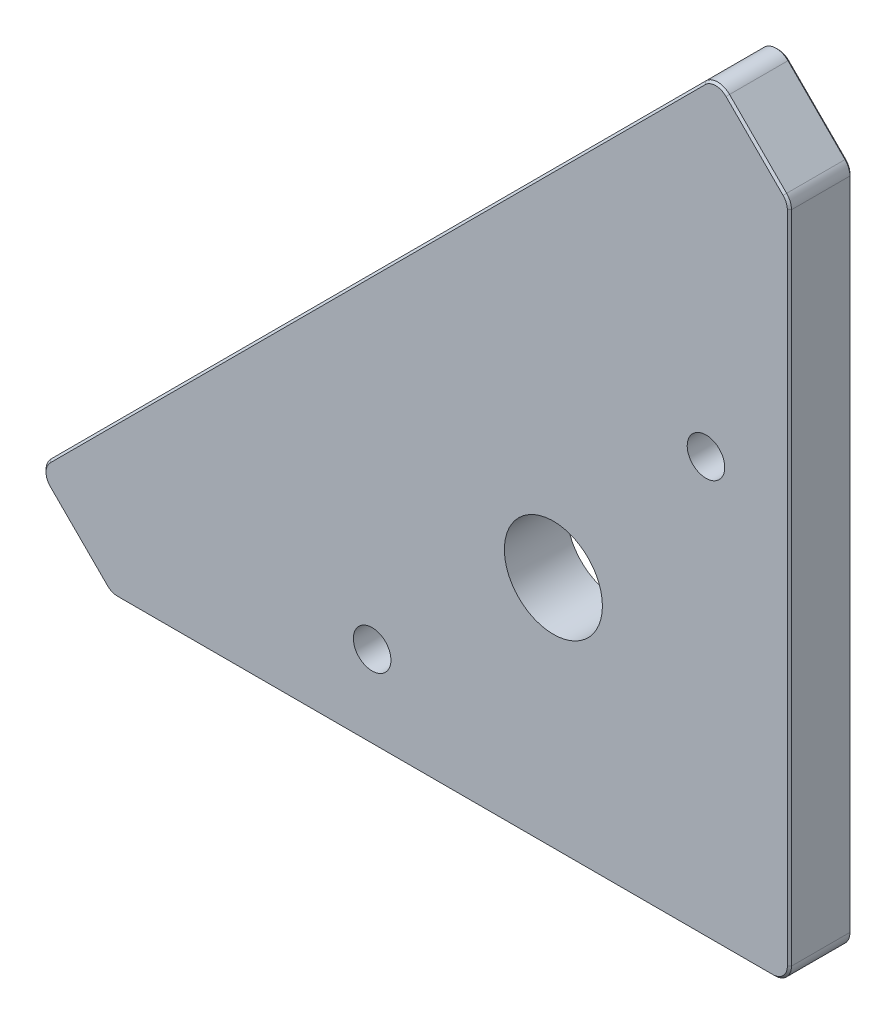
from build123d import *

# Parameters (mm, degrees)
AUFSATZ_LINEAR_AUSTRAGEN1_DEPTH                      = 15
SCHNITT_LINEAR_AUSTRAGEN2_DEPTH                      = 281.401497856
VERRUNDUNG1_R                                        = 4
M25X1_5_GEWINDEBOHRUNG1_D                            = 23.5
M25X1_5_GEWINDEBOHRUNG1_DEPTH                        = 57.5
M25X1_5_GEWINDEBOHRUNG1_TIP                          = 7.060112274
FORMSENKUNG_F_R_M8_SENKSCHRAUBE_MIT_INNE_D           = 9
FORMSENKUNG_F_R_M8_SENKSCHRAUBE_MIT_INNE_CSINK_D     = 18.25
FORMSENKUNG_F_R_M8_SENKSCHRAUBE_MIT_INNE_CSINK_ANGLE = 90
FASE1_SIZE                                           = 0.5


with BuildPart() as part:
    # Skizze1 → Aufsatz-Linear austragen1 (new body)
    with BuildSketch(Plane.XY):
        Polygon((0, 0), (-197.989898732, 0), (0, 197.989898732), align=None)
    extrude(amount=AUFSATZ_LINEAR_AUSTRAGEN1_DEPTH)

    # Skizze4 → Schnitt-Linear austragen2 (cut, through all)
    with BuildSketch(Plane(origin=(0, 0, 0), x_dir=(-1, 0, 0), z_dir=(0, 0, -1))):
        Polygon((0, 162.634559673), (17.67766953, 180.312229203), (0, 197.989898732), align=None)
        Polygon((162.634559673, 0), (180.312229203, 17.67766953), (197.989898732, 0), align=None)
    extrude(amount=-SCHNITT_LINEAR_AUSTRAGEN2_DEPTH, mode=Mode.SUBTRACT)

    # Verrundung1
    verrundung1_edges = [part.edges().sort_by_distance(p)[0] for p in [
        (0, 162.634559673, 7.5),
        (-17.67766953, 180.312229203, 7.5),
        (-162.634559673, 0, 7.5),
        (-180.312229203, 17.67766953, 7.5),
        (0, 0, 7.5),
    ]]
    fillet(verrundung1_edges, radius=VERRUNDUNG1_R)

    # M25x1.5 Gewindebohrung1
    with Locations(Plane.XY.offset(15)):
        with Locations((-56.568542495, 56.568542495)):
            Hole(M25X1_5_GEWINDEBOHRUNG1_D / 2, depth=M25X1_5_GEWINDEBOHRUNG1_DEPTH)
            with Locations((0, 0, -(M25X1_5_GEWINDEBOHRUNG1_DEPTH + M25X1_5_GEWINDEBOHRUNG1_TIP / 2))):  # 118° drill point
                Cone(0, M25X1_5_GEWINDEBOHRUNG1_D / 2, M25X1_5_GEWINDEBOHRUNG1_TIP, mode=Mode.SUBTRACT)

    # Formsenkung f_r M8 Senkschraube mit Inne (through all)
    with Locations(Plane(origin=(0, 0, 0), x_dir=(1, 0, 0), z_dir=(0, 0, -1))):
        with Locations((-20, -100), (-100, -20)):
            CounterSinkHole(FORMSENKUNG_F_R_M8_SENKSCHRAUBE_MIT_INNE_D / 2, FORMSENKUNG_F_R_M8_SENKSCHRAUBE_MIT_INNE_CSINK_D / 2, counter_sink_angle=FORMSENKUNG_F_R_M8_SENKSCHRAUBE_MIT_INNE_CSINK_ANGLE)

    # Fase1
    fase1_edges = [part.edges().sort_by_distance(p)[0] for p in [
        (-8.01040764, 170.644967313, 0),
        (-8.01040764, 170.644967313, 15),
        (0, 82.488852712, 0),
        (-82.488852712, 0, 0),
        (-170.644967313, 8.01040764, 0),
        (-98.994949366, 98.994949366, 0),
        (-1.171572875, 1.171572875, 0),
        (-162.508439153, 0.30448187, 0),
        (-178.655374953, 17.67766953, 0),
        (-17.67766953, 178.655374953, 0),
        (-0.30448187, 162.508439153, 0),
        (0, 82.488852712, 15),
        (-98.994949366, 98.994949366, 15),
        (-170.644967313, 8.01040764, 15),
        (-82.488852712, 0, 15),
        (-1.171572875, 1.171572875, 15),
        (-162.508439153, 0.30448187, 15),
        (-178.655374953, 17.67766953, 15),
        (-17.67766953, 178.655374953, 15),
        (-0.30448187, 162.508439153, 15),
    ]]
    chamfer(fase1_edges, length=FASE1_SIZE)


solid = part.part
